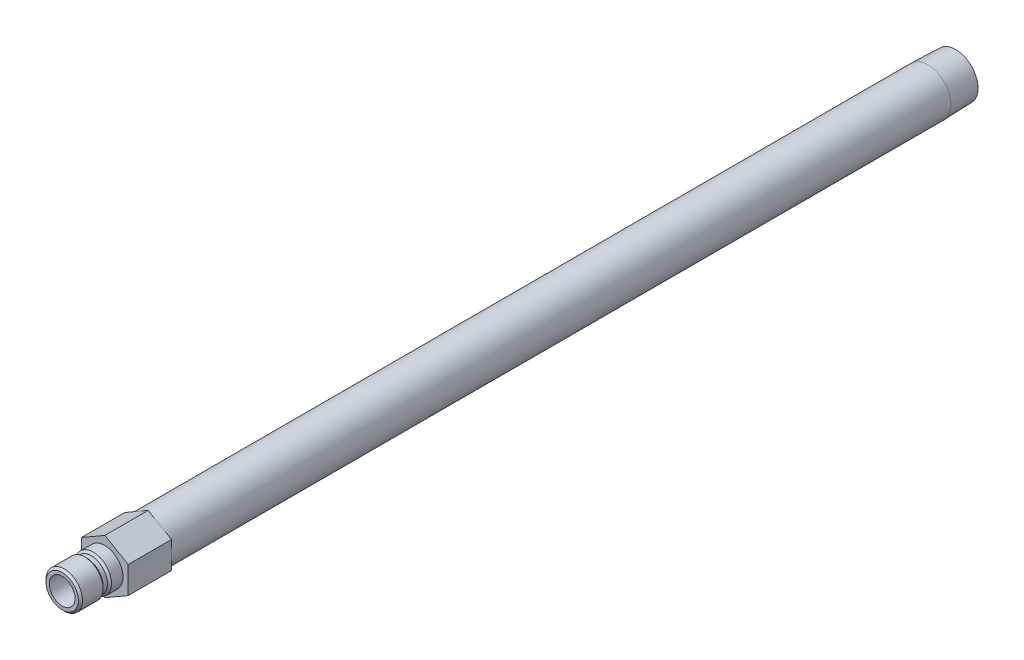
ISO-10303-21;
HEADER;
FILE_DESCRIPTION(('STEP AP214'),'2;1');
FILE_NAME('part.step','',(''),(''),'','','');
FILE_SCHEMA(('AUTOMOTIVE_DESIGN { 1 0 10303 214 1 1 1 1 }'));
ENDSEC;
DATA;
#1=APPLICATION_CONTEXT('core data for automotive mechanical design processes');
#2=APPLICATION_PROTOCOL_DEFINITION('international standard','automotive_design',2000,#1);
#3=PRODUCT_CONTEXT('',#1,'mechanical');
#4=PRODUCT('Part','Part','',(#3));
#5=PRODUCT_RELATED_PRODUCT_CATEGORY('part','',(#4));
#6=PRODUCT_DEFINITION_FORMATION('','',#4);
#7=PRODUCT_DEFINITION_CONTEXT('part definition',#1,'design');
#8=PRODUCT_DEFINITION('design','',#6,#7);
#9=PRODUCT_DEFINITION_SHAPE('','',#8);
#10=(LENGTH_UNIT() NAMED_UNIT(*) SI_UNIT(.MILLI.,.METRE.));
#11=(NAMED_UNIT(*) PLANE_ANGLE_UNIT() SI_UNIT($,.RADIAN.));
#12=(NAMED_UNIT(*) SI_UNIT($,.STERADIAN.) SOLID_ANGLE_UNIT());
#13=UNCERTAINTY_MEASURE_WITH_UNIT(LENGTH_MEASURE(1.E-05),#10,'distance_accuracy_value','');
#14=(GEOMETRIC_REPRESENTATION_CONTEXT(3) GLOBAL_UNCERTAINTY_ASSIGNED_CONTEXT((#13)) GLOBAL_UNIT_ASSIGNED_CONTEXT((#10,
#11,#12)) REPRESENTATION_CONTEXT('',''));
#15=CARTESIAN_POINT('',(0.,0.,0.));
#16=DIRECTION('',(0.,0.,1.));
#17=DIRECTION('',(1.,0.,0.));
#18=AXIS2_PLACEMENT_3D('',#15,#16,#17);
#19=CARTESIAN_POINT('',(0.,0.,0.));
#20=DIRECTION('',(0.,0.,-1.));
#21=DIRECTION('',(0.,1.,0.));
#22=AXIS2_PLACEMENT_3D('',#19,#20,#21);
#23=CYLINDRICAL_SURFACE('',#22,8.57249999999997);
#24=CARTESIAN_POINT('',(0.,0.,-304.1142));
#25=DIRECTION('',(0.,0.,-1.));
#26=DIRECTION('',(0.,1.,0.));
#27=AXIS2_PLACEMENT_3D('',#24,#25,#26);
#28=CIRCLE('',#27,8.57249999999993);
#29=CARTESIAN_POINT('',(0.,8.5725,-304.1142));
#30=VERTEX_POINT('',#29);
#31=EDGE_CURVE('E168',#30,#30,#28,.T.);
#32=ORIENTED_EDGE('',*,*,#31,.F.);
#33=EDGE_LOOP('',(#32));
#34=FACE_BOUND('',#33,.T.);
#35=CARTESIAN_POINT('',(0.,0.,-16.002));
#36=DIRECTION('',(0.,0.,1.));
#37=DIRECTION('',(1.,0.,0.));
#38=AXIS2_PLACEMENT_3D('',#35,#36,#37);
#39=CIRCLE('',#38,8.57249999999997);
#40=CARTESIAN_POINT('',(8.57249999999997,0.,-16.002));
#41=VERTEX_POINT('',#40);
#42=EDGE_CURVE('E37',#41,#41,#39,.F.);
#43=ORIENTED_EDGE('',*,*,#42,.T.);
#44=EDGE_LOOP('',(#43));
#45=FACE_BOUND('',#44,.T.);
#46=ADVANCED_FACE('F33',(#34,#45),#23,.T.);
#47=CARTESIAN_POINT('',(0.,0.,0.));
#48=DIRECTION('',(0.,0.,-1.));
#49=DIRECTION('',(0.,1.,0.));
#50=AXIS2_PLACEMENT_3D('',#47,#48,#49);
#51=CYLINDRICAL_SURFACE('',#50,4.7625);
#52=CARTESIAN_POINT('',(0.,0.,15.748));
#53=DIRECTION('',(0.,0.,-1.));
#54=DIRECTION('',(0.,1.,0.));
#55=AXIS2_PLACEMENT_3D('',#52,#53,#54);
#56=CIRCLE('',#55,4.7625);
#57=CARTESIAN_POINT('',(0.,4.7625,15.748));
#58=VERTEX_POINT('',#57);
#59=EDGE_CURVE('E144',#58,#58,#56,.T.);
#60=ORIENTED_EDGE('',*,*,#59,.F.);
#61=EDGE_LOOP('',(#60));
#62=FACE_BOUND('',#61,.T.);
#63=CARTESIAN_POINT('',(0.,0.,-16.002));
#64=DIRECTION('',(0.,0.,-1.));
#65=DIRECTION('',(0.,1.,0.));
#66=AXIS2_PLACEMENT_3D('',#63,#64,#65);
#67=CIRCLE('',#66,4.76249999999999);
#68=CARTESIAN_POINT('',(0.,4.7625,-16.002));
#69=VERTEX_POINT('',#68);
#70=EDGE_CURVE('E11',#69,#69,#67,.T.);
#71=ORIENTED_EDGE('',*,*,#70,.T.);
#72=EDGE_LOOP('',(#71));
#73=FACE_BOUND('',#72,.T.);
#74=ADVANCED_FACE('F35',(#62,#73),#51,.F.);
#75=CARTESIAN_POINT('',(0.,4.7625,-16.002));
#76=DIRECTION('',(0.,0.,-1.));
#77=DIRECTION('',(0.,1.,0.));
#78=AXIS2_PLACEMENT_3D('',#75,#76,#77);
#79=PLANE('',#78);
#80=CARTESIAN_POINT('',(0.,0.,-16.002));
#81=DIRECTION('',(0.,0.,-1.));
#82=DIRECTION('',(0.,1.,0.));
#83=AXIS2_PLACEMENT_3D('',#80,#81,#82);
#84=CIRCLE('',#83,6.26109999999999);
#85=CARTESIAN_POINT('',(0.,6.2611,-16.002));
#86=VERTEX_POINT('',#85);
#87=EDGE_CURVE('E43',#86,#86,#84,.T.);
#88=ORIENTED_EDGE('',*,*,#87,.T.);
#89=EDGE_LOOP('',(#88));
#90=FACE_BOUND('',#89,.T.);
#91=ORIENTED_EDGE('',*,*,#70,.F.);
#92=EDGE_LOOP('',(#91));
#93=FACE_BOUND('',#92,.T.);
#94=ADVANCED_FACE('F180',(#90,#93),#79,.T.);
#95=CARTESIAN_POINT('',(0.,0.,0.));
#96=DIRECTION('',(0.,0.,-1.));
#97=DIRECTION('',(0.,1.,0.));
#98=AXIS2_PLACEMENT_3D('',#95,#96,#97);
#99=CYLINDRICAL_SURFACE('',#98,6.26109999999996);
#100=CARTESIAN_POINT('',(0.,0.,-314.452));
#101=DIRECTION('',(0.,0.,-1.));
#102=DIRECTION('',(0.,1.,0.));
#103=AXIS2_PLACEMENT_3D('',#100,#101,#102);
#104=CIRCLE('',#103,6.26109999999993);
#105=CARTESIAN_POINT('',(0.,6.2611,-314.452));
#106=VERTEX_POINT('',#105);
#107=EDGE_CURVE('E174',#106,#106,#104,.T.);
#108=ORIENTED_EDGE('',*,*,#107,.T.);
#109=EDGE_LOOP('',(#108));
#110=FACE_BOUND('',#109,.T.);
#111=ORIENTED_EDGE('',*,*,#87,.F.);
#112=EDGE_LOOP('',(#111));
#113=FACE_BOUND('',#112,.T.);
#114=ADVANCED_FACE('F183',(#110,#113),#99,.F.);
#115=CARTESIAN_POINT('',(0.,8.24944566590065,-314.452));
#116=DIRECTION('',(0.,0.,-1.));
#117=DIRECTION('',(0.,1.,0.));
#118=AXIS2_PLACEMENT_3D('',#115,#116,#117);
#119=PLANE('',#118);
#120=CARTESIAN_POINT('',(0.,0.,-314.452));
#121=DIRECTION('',(0.,0.,-1.));
#122=DIRECTION('',(0.,1.,0.));
#123=AXIS2_PLACEMENT_3D('',#120,#121,#122);
#124=CIRCLE('',#123,8.24944566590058);
#125=CARTESIAN_POINT('',(0.,8.24944566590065,-314.452));
#126=VERTEX_POINT('',#125);
#127=EDGE_CURVE('E171',#126,#126,#124,.T.);
#128=ORIENTED_EDGE('',*,*,#127,.T.);
#129=EDGE_LOOP('',(#128));
#130=FACE_BOUND('',#129,.T.);
#131=ORIENTED_EDGE('',*,*,#107,.F.);
#132=EDGE_LOOP('',(#131));
#133=FACE_BOUND('',#132,.T.);
#134=ADVANCED_FACE('F185',(#130,#133),#119,.T.);
#135=CARTESIAN_POINT('',(0.,0.,-314.452));
#136=DIRECTION('',(0.,0.,1.));
#137=DIRECTION('',(0.,-1.,0.));
#138=AXIS2_PLACEMENT_3D('',#135,#136,#137);
#139=CONICAL_SURFACE('',#138,8.24944566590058,0.0312396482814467);
#140=ORIENTED_EDGE('',*,*,#31,.T.);
#141=EDGE_LOOP('',(#140));
#142=FACE_BOUND('',#141,.T.);
#143=ORIENTED_EDGE('',*,*,#127,.F.);
#144=EDGE_LOOP('',(#143));
#145=FACE_BOUND('',#144,.T.);
#146=ADVANCED_FACE('F192',(#142,#145),#139,.T.);
#147=CARTESIAN_POINT('',(0.,6.7437,0.));
#148=DIRECTION('',(0.,0.,1.));
#149=DIRECTION('',(0.,-1.,0.));
#150=AXIS2_PLACEMENT_3D('',#147,#148,#149);
#151=PLANE('',#150);
#152=CARTESIAN_POINT('',(0.,0.,0.));
#153=DIRECTION('',(0.,0.,-1.));
#154=DIRECTION('',(0.,1.,0.));
#155=AXIS2_PLACEMENT_3D('',#152,#153,#154);
#156=CIRCLE('',#155,6.7437);
#157=CARTESIAN_POINT('',(0.,6.7437,0.));
#158=VERTEX_POINT('',#157);
#159=EDGE_CURVE('E165',#158,#158,#156,.T.);
#160=ORIENTED_EDGE('',*,*,#159,.T.);
#161=EDGE_LOOP('',(#160));
#162=FACE_BOUND('',#161,.T.);
#163=DIRECTION('',(-0.866025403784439,-0.5,0.));
#164=VECTOR('',#163,1.);
#165=CARTESIAN_POINT('',(0.,9.97199384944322,0.));
#166=LINE('',#165,#164);
#167=CARTESIAN_POINT('',(0.,9.97199384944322,0.));
#168=VERTEX_POINT('',#167);
#169=CARTESIAN_POINT('',(-8.636,4.98599692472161,0.));
#170=VERTEX_POINT('',#169);
#171=EDGE_CURVE('E122',#168,#170,#166,.T.);
#172=ORIENTED_EDGE('',*,*,#171,.T.);
#173=DIRECTION('',(0.,-1.,0.));
#174=VECTOR('',#173,1.);
#175=CARTESIAN_POINT('',(-8.636,4.98599692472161,0.));
#176=LINE('',#175,#174);
#177=CARTESIAN_POINT('',(-8.636,-4.98599692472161,0.));
#178=VERTEX_POINT('',#177);
#179=EDGE_CURVE('E125',#170,#178,#176,.T.);
#180=ORIENTED_EDGE('',*,*,#179,.T.);
#181=DIRECTION('',(0.866025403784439,-0.5,0.));
#182=VECTOR('',#181,1.);
#183=CARTESIAN_POINT('',(-8.636,-4.98599692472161,0.));
#184=LINE('',#183,#182);
#185=CARTESIAN_POINT('',(0.,-9.97199384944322,0.));
#186=VERTEX_POINT('',#185);
#187=EDGE_CURVE('E128',#178,#186,#184,.T.);
#188=ORIENTED_EDGE('',*,*,#187,.T.);
#189=DIRECTION('',(0.866025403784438,0.5,0.));
#190=VECTOR('',#189,1.);
#191=CARTESIAN_POINT('',(0.,-9.97199384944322,0.));
#192=LINE('',#191,#190);
#193=CARTESIAN_POINT('',(8.63599999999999,-4.98599692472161,0.));
#194=VERTEX_POINT('',#193);
#195=EDGE_CURVE('E131',#186,#194,#192,.T.);
#196=ORIENTED_EDGE('',*,*,#195,.T.);
#197=DIRECTION('',(0.,1.,0.));
#198=VECTOR('',#197,1.);
#199=CARTESIAN_POINT('',(8.63599999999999,-4.98599692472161,0.));
#200=LINE('',#199,#198);
#201=CARTESIAN_POINT('',(8.636,4.98599692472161,0.));
#202=VERTEX_POINT('',#201);
#203=EDGE_CURVE('E99',#194,#202,#200,.T.);
#204=ORIENTED_EDGE('',*,*,#203,.T.);
#205=DIRECTION('',(-0.866025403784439,0.5,0.));
#206=VECTOR('',#205,1.);
#207=CARTESIAN_POINT('',(8.636,4.98599692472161,0.));
#208=LINE('',#207,#206);
#209=EDGE_CURVE('E134',#202,#168,#208,.T.);
#210=ORIENTED_EDGE('',*,*,#209,.T.);
#211=EDGE_LOOP('',(#172,#180,#188,#196,#204,#210));
#212=FACE_BOUND('',#211,.T.);
#213=ADVANCED_FACE('F206',(#162,#212),#151,.T.);
#214=CARTESIAN_POINT('',(0.,0.,0.));
#215=DIRECTION('',(0.,0.,-1.));
#216=DIRECTION('',(0.,1.,0.));
#217=AXIS2_PLACEMENT_3D('',#214,#215,#216);
#218=CYLINDRICAL_SURFACE('',#217,6.7437);
#219=CARTESIAN_POINT('',(0.,0.,4.25449999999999));
#220=DIRECTION('',(0.,0.,-1.));
#221=DIRECTION('',(0.,1.,0.));
#222=AXIS2_PLACEMENT_3D('',#219,#220,#221);
#223=CIRCLE('',#222,6.7437);
#224=CARTESIAN_POINT('',(0.,6.7437,4.2545));
#225=VERTEX_POINT('',#224);
#226=EDGE_CURVE('E162',#225,#225,#223,.T.);
#227=ORIENTED_EDGE('',*,*,#226,.T.);
#228=EDGE_LOOP('',(#227));
#229=FACE_BOUND('',#228,.T.);
#230=ORIENTED_EDGE('',*,*,#159,.F.);
#231=EDGE_LOOP('',(#230));
#232=FACE_BOUND('',#231,.T.);
#233=ADVANCED_FACE('F213',(#229,#232),#218,.T.);
#234=CARTESIAN_POINT('',(0.,0.,4.25449999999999));
#235=DIRECTION('',(0.,0.,-1.));
#236=DIRECTION('',(0.,1.,0.));
#237=AXIS2_PLACEMENT_3D('',#234,#235,#236);
#238=CONICAL_SURFACE('',#237,6.7437,0.785398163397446);
#239=CARTESIAN_POINT('',(0.,0.,5.0165));
#240=DIRECTION('',(0.,0.,-1.));
#241=DIRECTION('',(0.,1.,0.));
#242=AXIS2_PLACEMENT_3D('',#239,#240,#241);
#243=CIRCLE('',#242,5.9817);
#244=CARTESIAN_POINT('',(0.,5.9817,5.0165));
#245=VERTEX_POINT('',#244);
#246=EDGE_CURVE('E159',#245,#245,#243,.T.);
#247=ORIENTED_EDGE('',*,*,#246,.T.);
#248=EDGE_LOOP('',(#247));
#249=FACE_BOUND('',#248,.T.);
#250=ORIENTED_EDGE('',*,*,#226,.F.);
#251=EDGE_LOOP('',(#250));
#252=FACE_BOUND('',#251,.T.);
#253=ADVANCED_FACE('F222',(#249,#252),#238,.T.);
#254=CARTESIAN_POINT('',(0.,0.,0.));
#255=DIRECTION('',(0.,0.,-1.));
#256=DIRECTION('',(0.,1.,0.));
#257=AXIS2_PLACEMENT_3D('',#254,#255,#256);
#258=CYLINDRICAL_SURFACE('',#257,5.9817);
#259=CARTESIAN_POINT('',(0.,0.,6.604));
#260=DIRECTION('',(0.,0.,-1.));
#261=DIRECTION('',(0.,1.,0.));
#262=AXIS2_PLACEMENT_3D('',#259,#260,#261);
#263=CIRCLE('',#262,5.9817);
#264=CARTESIAN_POINT('',(0.,5.9817,6.604));
#265=VERTEX_POINT('',#264);
#266=EDGE_CURVE('E156',#265,#265,#263,.T.);
#267=ORIENTED_EDGE('',*,*,#266,.T.);
#268=EDGE_LOOP('',(#267));
#269=FACE_BOUND('',#268,.T.);
#270=ORIENTED_EDGE('',*,*,#246,.F.);
#271=EDGE_LOOP('',(#270));
#272=FACE_BOUND('',#271,.T.);
#273=ADVANCED_FACE('F263',(#269,#272),#258,.T.);
#274=CARTESIAN_POINT('',(0.,0.,6.604));
#275=DIRECTION('',(0.,0.,1.));
#276=DIRECTION('',(0.,-1.,0.));
#277=AXIS2_PLACEMENT_3D('',#274,#275,#276);
#278=CONICAL_SURFACE('',#277,5.9817,0.785398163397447);
#279=CARTESIAN_POINT('',(0.,0.,7.366));
#280=DIRECTION('',(0.,0.,-1.));
#281=DIRECTION('',(0.,1.,0.));
#282=AXIS2_PLACEMENT_3D('',#279,#280,#281);
#283=CIRCLE('',#282,6.7437);
#284=CARTESIAN_POINT('',(0.,6.7437,7.366));
#285=VERTEX_POINT('',#284);
#286=EDGE_CURVE('E153',#285,#285,#283,.T.);
#287=ORIENTED_EDGE('',*,*,#286,.T.);
#288=EDGE_LOOP('',(#287));
#289=FACE_BOUND('',#288,.T.);
#290=ORIENTED_EDGE('',*,*,#266,.F.);
#291=EDGE_LOOP('',(#290));
#292=FACE_BOUND('',#291,.T.);
#293=ADVANCED_FACE('F259',(#289,#292),#278,.T.);
#294=CARTESIAN_POINT('',(0.,0.,0.));
#295=DIRECTION('',(0.,0.,-1.));
#296=DIRECTION('',(0.,1.,0.));
#297=AXIS2_PLACEMENT_3D('',#294,#295,#296);
#298=CYLINDRICAL_SURFACE('',#297,6.7437);
#299=CARTESIAN_POINT('',(0.,0.,14.986));
#300=DIRECTION('',(0.,0.,-1.));
#301=DIRECTION('',(0.,1.,0.));
#302=AXIS2_PLACEMENT_3D('',#299,#300,#301);
#303=CIRCLE('',#302,6.7437);
#304=CARTESIAN_POINT('',(0.,6.7437,14.986));
#305=VERTEX_POINT('',#304);
#306=EDGE_CURVE('E150',#305,#305,#303,.T.);
#307=ORIENTED_EDGE('',*,*,#306,.T.);
#308=EDGE_LOOP('',(#307));
#309=FACE_BOUND('',#308,.T.);
#310=ORIENTED_EDGE('',*,*,#286,.F.);
#311=EDGE_LOOP('',(#310));
#312=FACE_BOUND('',#311,.T.);
#313=ADVANCED_FACE('F255',(#309,#312),#298,.T.);
#314=CARTESIAN_POINT('',(0.,0.,14.986));
#315=DIRECTION('',(0.,0.,-1.));
#316=DIRECTION('',(0.,1.,0.));
#317=AXIS2_PLACEMENT_3D('',#314,#315,#316);
#318=CONICAL_SURFACE('',#317,6.7437,0.785398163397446);
#319=CARTESIAN_POINT('',(0.,0.,15.748));
#320=DIRECTION('',(0.,0.,-1.));
#321=DIRECTION('',(0.,1.,0.));
#322=AXIS2_PLACEMENT_3D('',#319,#320,#321);
#323=CIRCLE('',#322,5.9817);
#324=CARTESIAN_POINT('',(0.,5.9817,15.748));
#325=VERTEX_POINT('',#324);
#326=EDGE_CURVE('E147',#325,#325,#323,.T.);
#327=ORIENTED_EDGE('',*,*,#326,.T.);
#328=EDGE_LOOP('',(#327));
#329=FACE_BOUND('',#328,.T.);
#330=ORIENTED_EDGE('',*,*,#306,.F.);
#331=EDGE_LOOP('',(#330));
#332=FACE_BOUND('',#331,.T.);
#333=ADVANCED_FACE('F251',(#329,#332),#318,.T.);
#334=CARTESIAN_POINT('',(0.,4.7625,15.748));
#335=DIRECTION('',(0.,0.,1.));
#336=DIRECTION('',(0.,-1.,0.));
#337=AXIS2_PLACEMENT_3D('',#334,#335,#336);
#338=PLANE('',#337);
#339=ORIENTED_EDGE('',*,*,#59,.T.);
#340=EDGE_LOOP('',(#339));
#341=FACE_BOUND('',#340,.T.);
#342=ORIENTED_EDGE('',*,*,#326,.F.);
#343=EDGE_LOOP('',(#342));
#344=FACE_BOUND('',#343,.T.);
#345=ADVANCED_FACE('F239',(#341,#344),#338,.T.);
#346=CARTESIAN_POINT('',(0.,9.97199384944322,-16.002));
#347=DIRECTION('',(-0.5,0.866025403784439,0.));
#348=DIRECTION('',(-0.866025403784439,-0.5,0.));
#349=AXIS2_PLACEMENT_3D('',#346,#347,#348);
#350=PLANE('',#349);
#351=ORIENTED_EDGE('',*,*,#171,.F.);
#352=DIRECTION('',(0.,0.,1.));
#353=VECTOR('',#352,1.);
#354=CARTESIAN_POINT('',(0.,9.97199384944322,-16.002));
#355=LINE('',#354,#353);
#356=CARTESIAN_POINT('',(0.,9.97199384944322,-16.002));
#357=VERTEX_POINT('',#356);
#358=EDGE_CURVE('E51',#357,#168,#355,.T.);
#359=ORIENTED_EDGE('',*,*,#358,.F.);
#360=DIRECTION('',(-0.866025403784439,-0.5,0.));
#361=VECTOR('',#360,1.);
#362=CARTESIAN_POINT('',(0.,9.97199384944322,-16.002));
#363=LINE('',#362,#361);
#364=CARTESIAN_POINT('',(-8.636,4.98599692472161,-16.002));
#365=VERTEX_POINT('',#364);
#366=EDGE_CURVE('E137',#357,#365,#363,.T.);
#367=ORIENTED_EDGE('',*,*,#366,.T.);
#368=DIRECTION('',(0.,0.,1.));
#369=VECTOR('',#368,1.);
#370=CARTESIAN_POINT('',(-8.636,4.98599692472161,-16.002));
#371=LINE('',#370,#369);
#372=EDGE_CURVE('E86',#365,#170,#371,.T.);
#373=ORIENTED_EDGE('',*,*,#372,.T.);
#374=EDGE_LOOP('',(#351,#359,#367,#373));
#375=FACE_BOUND('',#374,.T.);
#376=ADVANCED_FACE('F226',(#375),#350,.T.);
#377=CARTESIAN_POINT('',(8.636,4.98599692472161,-16.002));
#378=DIRECTION('',(0.5,0.866025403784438,0.));
#379=DIRECTION('',(-0.866025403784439,0.5,0.));
#380=AXIS2_PLACEMENT_3D('',#377,#378,#379);
#381=PLANE('',#380);
#382=ORIENTED_EDGE('',*,*,#209,.F.);
#383=DIRECTION('',(0.,0.,1.));
#384=VECTOR('',#383,1.);
#385=CARTESIAN_POINT('',(8.636,4.98599692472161,-16.002));
#386=LINE('',#385,#384);
#387=CARTESIAN_POINT('',(8.636,4.98599692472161,-16.002));
#388=VERTEX_POINT('',#387);
#389=EDGE_CURVE('E74',#388,#202,#386,.T.);
#390=ORIENTED_EDGE('',*,*,#389,.F.);
#391=DIRECTION('',(-0.866025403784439,0.5,0.));
#392=VECTOR('',#391,1.);
#393=CARTESIAN_POINT('',(8.636,4.98599692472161,-16.002));
#394=LINE('',#393,#392);
#395=EDGE_CURVE('E112',#388,#357,#394,.T.);
#396=ORIENTED_EDGE('',*,*,#395,.T.);
#397=ORIENTED_EDGE('',*,*,#358,.T.);
#398=EDGE_LOOP('',(#382,#390,#396,#397));
#399=FACE_BOUND('',#398,.T.);
#400=ADVANCED_FACE('F231',(#399),#381,.T.);
#401=CARTESIAN_POINT('',(8.63599999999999,-4.98599692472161,-16.002));
#402=DIRECTION('',(1.,0.,0.));
#403=DIRECTION('',(0.,1.,0.));
#404=AXIS2_PLACEMENT_3D('',#401,#402,#403);
#405=PLANE('',#404);
#406=ORIENTED_EDGE('',*,*,#203,.F.);
#407=DIRECTION('',(0.,0.,1.));
#408=VECTOR('',#407,1.);
#409=CARTESIAN_POINT('',(8.63599999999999,-4.98599692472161,-16.002));
#410=LINE('',#409,#408);
#411=CARTESIAN_POINT('',(8.63599999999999,-4.98599692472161,-16.002));
#412=VERTEX_POINT('',#411);
#413=EDGE_CURVE('E94',#412,#194,#410,.T.);
#414=ORIENTED_EDGE('',*,*,#413,.F.);
#415=DIRECTION('',(0.,1.,0.));
#416=VECTOR('',#415,1.);
#417=CARTESIAN_POINT('',(8.63599999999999,-4.98599692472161,-16.002));
#418=LINE('',#417,#416);
#419=EDGE_CURVE('E97',#412,#388,#418,.T.);
#420=ORIENTED_EDGE('',*,*,#419,.T.);
#421=ORIENTED_EDGE('',*,*,#389,.T.);
#422=EDGE_LOOP('',(#406,#414,#420,#421));
#423=FACE_BOUND('',#422,.T.);
#424=ADVANCED_FACE('F96',(#423),#405,.T.);
#425=CARTESIAN_POINT('',(0.,-9.97199384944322,-16.002));
#426=DIRECTION('',(0.5,-0.866025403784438,0.));
#427=DIRECTION('',(0.866025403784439,0.5,0.));
#428=AXIS2_PLACEMENT_3D('',#425,#426,#427);
#429=PLANE('',#428);
#430=ORIENTED_EDGE('',*,*,#195,.F.);
#431=DIRECTION('',(0.,0.,1.));
#432=VECTOR('',#431,1.);
#433=CARTESIAN_POINT('',(0.,-9.97199384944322,-16.002));
#434=LINE('',#433,#432);
#435=CARTESIAN_POINT('',(0.,-9.97199384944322,-16.002));
#436=VERTEX_POINT('',#435);
#437=EDGE_CURVE('E104',#436,#186,#434,.T.);
#438=ORIENTED_EDGE('',*,*,#437,.F.);
#439=DIRECTION('',(0.866025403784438,0.5,0.));
#440=VECTOR('',#439,1.);
#441=CARTESIAN_POINT('',(0.,-9.97199384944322,-16.002));
#442=LINE('',#441,#440);
#443=EDGE_CURVE('E110',#436,#412,#442,.T.);
#444=ORIENTED_EDGE('',*,*,#443,.T.);
#445=ORIENTED_EDGE('',*,*,#413,.T.);
#446=EDGE_LOOP('',(#430,#438,#444,#445));
#447=FACE_BOUND('',#446,.T.);
#448=ADVANCED_FACE('F114',(#447),#429,.T.);
#449=CARTESIAN_POINT('',(-8.636,-4.98599692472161,-16.002));
#450=DIRECTION('',(-0.5,-0.866025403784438,0.));
#451=DIRECTION('',(0.866025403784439,-0.5,0.));
#452=AXIS2_PLACEMENT_3D('',#449,#450,#451);
#453=PLANE('',#452);
#454=ORIENTED_EDGE('',*,*,#187,.F.);
#455=DIRECTION('',(0.,0.,1.));
#456=VECTOR('',#455,1.);
#457=CARTESIAN_POINT('',(-8.636,-4.98599692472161,-16.002));
#458=LINE('',#457,#456);
#459=CARTESIAN_POINT('',(-8.636,-4.98599692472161,-16.002));
#460=VERTEX_POINT('',#459);
#461=EDGE_CURVE('E141',#460,#178,#458,.T.);
#462=ORIENTED_EDGE('',*,*,#461,.F.);
#463=DIRECTION('',(0.866025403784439,-0.5,0.));
#464=VECTOR('',#463,1.);
#465=CARTESIAN_POINT('',(-8.636,-4.98599692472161,-16.002));
#466=LINE('',#465,#464);
#467=EDGE_CURVE('E115',#460,#436,#466,.T.);
#468=ORIENTED_EDGE('',*,*,#467,.T.);
#469=ORIENTED_EDGE('',*,*,#437,.T.);
#470=EDGE_LOOP('',(#454,#462,#468,#469));
#471=FACE_BOUND('',#470,.T.);
#472=ADVANCED_FACE('F230',(#471),#453,.T.);
#473=CARTESIAN_POINT('',(-8.636,4.98599692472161,-16.002));
#474=DIRECTION('',(-1.,0.,0.));
#475=DIRECTION('',(0.,0.,1.));
#476=AXIS2_PLACEMENT_3D('',#473,#474,#475);
#477=PLANE('',#476);
#478=ORIENTED_EDGE('',*,*,#179,.F.);
#479=ORIENTED_EDGE('',*,*,#372,.F.);
#480=DIRECTION('',(0.,-1.,0.));
#481=VECTOR('',#480,1.);
#482=CARTESIAN_POINT('',(-8.636,4.98599692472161,-16.002));
#483=LINE('',#482,#481);
#484=EDGE_CURVE('E117',#365,#460,#483,.T.);
#485=ORIENTED_EDGE('',*,*,#484,.T.);
#486=ORIENTED_EDGE('',*,*,#461,.T.);
#487=EDGE_LOOP('',(#478,#479,#485,#486));
#488=FACE_BOUND('',#487,.T.);
#489=ADVANCED_FACE('F227',(#488),#477,.T.);
#490=CARTESIAN_POINT('',(-8.636,4.98599692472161,-16.002));
#491=DIRECTION('',(0.,0.,1.));
#492=DIRECTION('',(1.,0.,0.));
#493=AXIS2_PLACEMENT_3D('',#490,#491,#492);
#494=PLANE('',#493);
#495=ORIENTED_EDGE('',*,*,#42,.F.);
#496=EDGE_LOOP('',(#495));
#497=FACE_BOUND('',#496,.T.);
#498=ORIENTED_EDGE('',*,*,#366,.F.);
#499=ORIENTED_EDGE('',*,*,#395,.F.);
#500=ORIENTED_EDGE('',*,*,#419,.F.);
#501=ORIENTED_EDGE('',*,*,#443,.F.);
#502=ORIENTED_EDGE('',*,*,#467,.F.);
#503=ORIENTED_EDGE('',*,*,#484,.F.);
#504=EDGE_LOOP('',(#498,#499,#500,#501,#502,#503));
#505=FACE_BOUND('',#504,.T.);
#506=ADVANCED_FACE('F108',(#497,#505),#494,.F.);
#507=CLOSED_SHELL('',(#46,#74,#94,#114,#134,#146,#213,#233,#253,#273,#293,#313,#333,#345,#376,
#400,#424,#448,#472,#489,#506));
#508=MANIFOLD_SOLID_BREP('B2',#507);
#509=ADVANCED_BREP_SHAPE_REPRESENTATION('',(#18,#508),#14);
#510=SHAPE_DEFINITION_REPRESENTATION(#9,#509);
ENDSEC;
END-ISO-10303-21;
